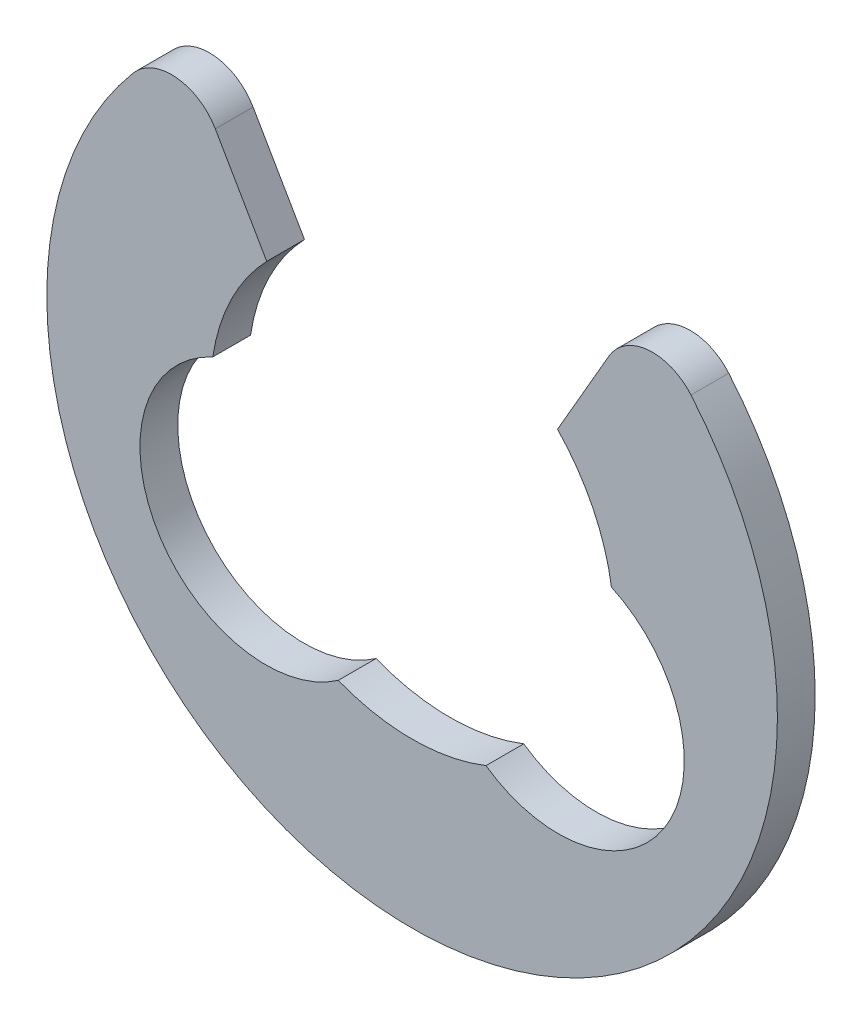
ISO-10303-21;
HEADER;
FILE_DESCRIPTION(('STEP AP214'),'2;1');
FILE_NAME('part.step','',(''),(''),'','','');
FILE_SCHEMA(('AUTOMOTIVE_DESIGN { 1 0 10303 214 1 1 1 1 }'));
ENDSEC;
DATA;
#1=APPLICATION_CONTEXT('core data for automotive mechanical design processes');
#2=APPLICATION_PROTOCOL_DEFINITION('international standard','automotive_design',2000,#1);
#3=PRODUCT_CONTEXT('',#1,'mechanical');
#4=PRODUCT('Part','Part','',(#3));
#5=PRODUCT_RELATED_PRODUCT_CATEGORY('part','',(#4));
#6=PRODUCT_DEFINITION_FORMATION('','',#4);
#7=PRODUCT_DEFINITION_CONTEXT('part definition',#1,'design');
#8=PRODUCT_DEFINITION('design','',#6,#7);
#9=PRODUCT_DEFINITION_SHAPE('','',#8);
#10=(LENGTH_UNIT() NAMED_UNIT(*) SI_UNIT(.MILLI.,.METRE.));
#11=(NAMED_UNIT(*) PLANE_ANGLE_UNIT() SI_UNIT($,.RADIAN.));
#12=(NAMED_UNIT(*) SI_UNIT($,.STERADIAN.) SOLID_ANGLE_UNIT());
#13=UNCERTAINTY_MEASURE_WITH_UNIT(LENGTH_MEASURE(1.E-05),#10,'distance_accuracy_value','');
#14=(GEOMETRIC_REPRESENTATION_CONTEXT(3) GLOBAL_UNCERTAINTY_ASSIGNED_CONTEXT((#13)) GLOBAL_UNIT_ASSIGNED_CONTEXT((#10,
#11,#12)) REPRESENTATION_CONTEXT('',''));
#15=CARTESIAN_POINT('',(0.,0.,0.));
#16=DIRECTION('',(0.,0.,1.));
#17=DIRECTION('',(1.,0.,0.));
#18=AXIS2_PLACEMENT_3D('',#15,#16,#17);
#19=CARTESIAN_POINT('',(0.,0.,1.5));
#20=DIRECTION('',(0.,0.,-1.));
#21=DIRECTION('',(-1.,0.,0.));
#22=AXIS2_PLACEMENT_3D('',#19,#20,#21);
#23=CYLINDRICAL_SURFACE('',#22,8.);
#24=CARTESIAN_POINT('',(0.,0.,0.));
#25=DIRECTION('',(0.,0.,-1.));
#26=DIRECTION('',(1.,0.,0.));
#27=AXIS2_PLACEMENT_3D('',#24,#25,#26);
#28=CIRCLE('',#27,8.);
#29=CARTESIAN_POINT('',(-7.91202775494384,1.18313854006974,0.));
#30=VERTEX_POINT('',#29);
#31=CARTESIAN_POINT('',(-5.77134299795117,5.54,0.));
#32=VERTEX_POINT('',#31);
#33=EDGE_CURVE('E127',#30,#32,#28,.T.);
#34=ORIENTED_EDGE('',*,*,#33,.T.);
#35=DIRECTION('',(0.,0.,-1.));
#36=VECTOR('',#35,1.);
#37=CARTESIAN_POINT('',(-5.77134299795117,5.54,1.5));
#38=LINE('',#37,#36);
#39=CARTESIAN_POINT('',(-5.77134299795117,5.54,1.5));
#40=VERTEX_POINT('',#39);
#41=EDGE_CURVE('E110',#40,#32,#38,.T.);
#42=ORIENTED_EDGE('',*,*,#41,.F.);
#43=CARTESIAN_POINT('',(0.,0.,1.5));
#44=DIRECTION('',(0.,0.,-1.));
#45=DIRECTION('',(1.,0.,0.));
#46=AXIS2_PLACEMENT_3D('',#43,#44,#45);
#47=CIRCLE('',#46,8.);
#48=CARTESIAN_POINT('',(-7.91202775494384,1.18313854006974,1.5));
#49=VERTEX_POINT('',#48);
#50=EDGE_CURVE('E115',#49,#40,#47,.T.);
#51=ORIENTED_EDGE('',*,*,#50,.F.);
#52=DIRECTION('',(0.,0.,-1.));
#53=VECTOR('',#52,1.);
#54=CARTESIAN_POINT('',(-7.91202775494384,1.18313854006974,1.5));
#55=LINE('',#54,#53);
#56=EDGE_CURVE('E181',#49,#30,#55,.T.);
#57=ORIENTED_EDGE('',*,*,#56,.T.);
#58=EDGE_LOOP('',(#34,#42,#51,#57));
#59=FACE_BOUND('',#58,.T.);
#60=ADVANCED_FACE('F30',(#59),#23,.F.);
#61=CARTESIAN_POINT('',(-5.77134299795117,5.54,1.5));
#62=DIRECTION('',(-0.866025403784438,-0.500000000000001,0.));
#63=DIRECTION('',(0.500000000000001,-0.866025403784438,0.));
#64=AXIS2_PLACEMENT_3D('',#61,#62,#63);
#65=PLANE('',#64);
#66=DIRECTION('',(-0.500000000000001,0.866025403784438,0.));
#67=VECTOR('',#66,1.);
#68=CARTESIAN_POINT('',(-5.77134299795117,5.54,0.));
#69=LINE('',#68,#67);
#70=CARTESIAN_POINT('',(-7.81121784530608,9.0731668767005,0.));
#71=VERTEX_POINT('',#70);
#72=EDGE_CURVE('E168',#32,#71,#69,.T.);
#73=ORIENTED_EDGE('',*,*,#72,.T.);
#74=DIRECTION('',(0.,0.,-1.));
#75=VECTOR('',#74,1.);
#76=CARTESIAN_POINT('',(-7.81121784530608,9.07316687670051,1.5));
#77=LINE('',#76,#75);
#78=CARTESIAN_POINT('',(-7.81121784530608,9.0731668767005,1.5));
#79=VERTEX_POINT('',#78);
#80=EDGE_CURVE('E11',#71,#79,#77,.F.);
#81=ORIENTED_EDGE('',*,*,#80,.T.);
#82=DIRECTION('',(-0.500000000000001,0.866025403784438,0.));
#83=VECTOR('',#82,1.);
#84=CARTESIAN_POINT('',(-5.77134299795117,5.54,1.5));
#85=LINE('',#84,#83);
#86=EDGE_CURVE('E106',#40,#79,#85,.T.);
#87=ORIENTED_EDGE('',*,*,#86,.F.);
#88=ORIENTED_EDGE('',*,*,#41,.T.);
#89=EDGE_LOOP('',(#73,#81,#87,#88));
#90=FACE_BOUND('',#89,.T.);
#91=ADVANCED_FACE('F108',(#90),#65,.F.);
#92=CARTESIAN_POINT('',(0.,0.,1.5));
#93=DIRECTION('',(0.,0.,-1.));
#94=DIRECTION('',(-1.,0.,0.));
#95=AXIS2_PLACEMENT_3D('',#92,#93,#94);
#96=CYLINDRICAL_SURFACE('',#95,14.5);
#97=CARTESIAN_POINT('',(0.,0.,0.));
#98=DIRECTION('',(0.,0.,1.));
#99=DIRECTION('',(1.,0.,0.));
#100=AXIS2_PLACEMENT_3D('',#97,#98,#99);
#101=CIRCLE('',#100,14.5);
#102=CARTESIAN_POINT('',(-11.070191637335,9.36487357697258,0.));
#103=VERTEX_POINT('',#102);
#104=CARTESIAN_POINT('',(11.070191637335,9.36487357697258,0.));
#105=VERTEX_POINT('',#104);
#106=EDGE_CURVE('E163',#103,#105,#101,.T.);
#107=ORIENTED_EDGE('',*,*,#106,.T.);
#108=DIRECTION('',(0.,0.,-1.));
#109=VECTOR('',#108,1.);
#110=CARTESIAN_POINT('',(11.070191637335,9.36487357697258,1.5));
#111=LINE('',#110,#109);
#112=CARTESIAN_POINT('',(11.070191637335,9.36487357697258,1.5));
#113=VERTEX_POINT('',#112);
#114=EDGE_CURVE('E51',#105,#113,#111,.F.);
#115=ORIENTED_EDGE('',*,*,#114,.T.);
#116=CARTESIAN_POINT('',(0.,0.,1.5));
#117=DIRECTION('',(0.,0.,1.));
#118=DIRECTION('',(1.,0.,0.));
#119=AXIS2_PLACEMENT_3D('',#116,#117,#118);
#120=CIRCLE('',#119,14.5);
#121=CARTESIAN_POINT('',(-11.070191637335,9.36487357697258,1.5));
#122=VERTEX_POINT('',#121);
#123=EDGE_CURVE('E114',#122,#113,#120,.T.);
#124=ORIENTED_EDGE('',*,*,#123,.F.);
#125=DIRECTION('',(0.,0.,-1.));
#126=VECTOR('',#125,1.);
#127=CARTESIAN_POINT('',(-11.070191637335,9.36487357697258,1.5));
#128=LINE('',#127,#126);
#129=EDGE_CURVE('E142',#122,#103,#128,.T.);
#130=ORIENTED_EDGE('',*,*,#129,.T.);
#131=EDGE_LOOP('',(#107,#115,#124,#130));
#132=FACE_BOUND('',#131,.T.);
#133=ADVANCED_FACE('F166',(#132),#96,.T.);
#134=CARTESIAN_POINT('',(5.77134299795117,5.54,1.5));
#135=DIRECTION('',(0.866025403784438,-0.500000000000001,0.));
#136=DIRECTION('',(0.500000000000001,0.866025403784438,0.));
#137=AXIS2_PLACEMENT_3D('',#134,#135,#136);
#138=PLANE('',#137);
#139=DIRECTION('',(-0.500000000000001,-0.866025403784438,0.));
#140=VECTOR('',#139,1.);
#141=CARTESIAN_POINT('',(5.77134299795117,5.54,1.5));
#142=LINE('',#141,#140);
#143=CARTESIAN_POINT('',(7.81121784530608,9.0731668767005,1.5));
#144=VERTEX_POINT('',#143);
#145=CARTESIAN_POINT('',(5.77134299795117,5.54,1.5));
#146=VERTEX_POINT('',#145);
#147=EDGE_CURVE('E149',#144,#146,#142,.T.);
#148=ORIENTED_EDGE('',*,*,#147,.F.);
#149=DIRECTION('',(0.,0.,-1.));
#150=VECTOR('',#149,1.);
#151=CARTESIAN_POINT('',(7.81121784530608,9.07316687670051,1.5));
#152=LINE('',#151,#150);
#153=CARTESIAN_POINT('',(7.81121784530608,9.0731668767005,0.));
#154=VERTEX_POINT('',#153);
#155=EDGE_CURVE('E128',#144,#154,#152,.T.);
#156=ORIENTED_EDGE('',*,*,#155,.T.);
#157=DIRECTION('',(-0.500000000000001,-0.866025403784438,0.));
#158=VECTOR('',#157,1.);
#159=CARTESIAN_POINT('',(5.77134299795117,5.54,0.));
#160=LINE('',#159,#158);
#161=CARTESIAN_POINT('',(5.77134299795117,5.54,0.));
#162=VERTEX_POINT('',#161);
#163=EDGE_CURVE('E165',#154,#162,#160,.T.);
#164=ORIENTED_EDGE('',*,*,#163,.T.);
#165=DIRECTION('',(0.,0.,-1.));
#166=VECTOR('',#165,1.);
#167=CARTESIAN_POINT('',(5.77134299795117,5.54,1.5));
#168=LINE('',#167,#166);
#169=EDGE_CURVE('E129',#146,#162,#168,.T.);
#170=ORIENTED_EDGE('',*,*,#169,.F.);
#171=EDGE_LOOP('',(#148,#156,#164,#170));
#172=FACE_BOUND('',#171,.T.);
#173=ADVANCED_FACE('F154',(#172),#138,.F.);
#174=CARTESIAN_POINT('',(0.,0.,1.5));
#175=DIRECTION('',(0.,0.,-1.));
#176=DIRECTION('',(-1.,0.,0.));
#177=AXIS2_PLACEMENT_3D('',#174,#175,#176);
#178=CYLINDRICAL_SURFACE('',#177,8.);
#179=CARTESIAN_POINT('',(0.,0.,0.));
#180=DIRECTION('',(0.,0.,-1.));
#181=DIRECTION('',(1.,0.,0.));
#182=AXIS2_PLACEMENT_3D('',#179,#180,#181);
#183=CIRCLE('',#182,8.);
#184=CARTESIAN_POINT('',(7.91202775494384,1.18313854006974,0.));
#185=VERTEX_POINT('',#184);
#186=EDGE_CURVE('E170',#162,#185,#183,.T.);
#187=ORIENTED_EDGE('',*,*,#186,.T.);
#188=DIRECTION('',(0.,0.,-1.));
#189=VECTOR('',#188,1.);
#190=CARTESIAN_POINT('',(7.91202775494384,1.18313854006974,1.5));
#191=LINE('',#190,#189);
#192=CARTESIAN_POINT('',(7.91202775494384,1.18313854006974,1.5));
#193=VERTEX_POINT('',#192);
#194=EDGE_CURVE('E135',#193,#185,#191,.T.);
#195=ORIENTED_EDGE('',*,*,#194,.F.);
#196=CARTESIAN_POINT('',(0.,0.,1.5));
#197=DIRECTION('',(0.,0.,-1.));
#198=DIRECTION('',(1.,0.,0.));
#199=AXIS2_PLACEMENT_3D('',#196,#197,#198);
#200=CIRCLE('',#199,8.);
#201=EDGE_CURVE('E157',#146,#193,#200,.T.);
#202=ORIENTED_EDGE('',*,*,#201,.F.);
#203=ORIENTED_EDGE('',*,*,#169,.T.);
#204=EDGE_LOOP('',(#187,#195,#202,#203));
#205=FACE_BOUND('',#204,.T.);
#206=ADVANCED_FACE('F211',(#205),#178,.F.);
#207=CARTESIAN_POINT('',(5.80237020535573,-3.35000000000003,1.5));
#208=DIRECTION('',(0.,0.,-1.));
#209=DIRECTION('',(-1.,0.,0.));
#210=AXIS2_PLACEMENT_3D('',#207,#208,#209);
#211=CYLINDRICAL_SURFACE('',#210,5.);
#212=CARTESIAN_POINT('',(5.80237020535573,-3.35000000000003,0.));
#213=DIRECTION('',(0.,0.,-1.));
#214=DIRECTION('',(1.,0.,0.));
#215=AXIS2_PLACEMENT_3D('',#212,#213,#214);
#216=CIRCLE('',#215,5.);
#217=CARTESIAN_POINT('',(2.93138584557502,-7.44358630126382,0.));
#218=VERTEX_POINT('',#217);
#219=EDGE_CURVE('E176',#185,#218,#216,.T.);
#220=ORIENTED_EDGE('',*,*,#219,.T.);
#221=DIRECTION('',(0.,0.,-1.));
#222=VECTOR('',#221,1.);
#223=CARTESIAN_POINT('',(2.93138584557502,-7.44358630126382,1.5));
#224=LINE('',#223,#222);
#225=CARTESIAN_POINT('',(2.93138584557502,-7.44358630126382,1.5));
#226=VERTEX_POINT('',#225);
#227=EDGE_CURVE('E186',#226,#218,#224,.T.);
#228=ORIENTED_EDGE('',*,*,#227,.F.);
#229=CARTESIAN_POINT('',(5.80237020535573,-3.35000000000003,1.5));
#230=DIRECTION('',(0.,0.,-1.));
#231=DIRECTION('',(1.,0.,0.));
#232=AXIS2_PLACEMENT_3D('',#229,#230,#231);
#233=CIRCLE('',#232,5.);
#234=EDGE_CURVE('E195',#193,#226,#233,.T.);
#235=ORIENTED_EDGE('',*,*,#234,.F.);
#236=ORIENTED_EDGE('',*,*,#194,.T.);
#237=EDGE_LOOP('',(#220,#228,#235,#236));
#238=FACE_BOUND('',#237,.T.);
#239=ADVANCED_FACE('F193',(#238),#211,.F.);
#240=CARTESIAN_POINT('',(0.,0.,1.5));
#241=DIRECTION('',(0.,0.,-1.));
#242=DIRECTION('',(-1.,0.,0.));
#243=AXIS2_PLACEMENT_3D('',#240,#241,#242);
#244=CYLINDRICAL_SURFACE('',#243,8.);
#245=CARTESIAN_POINT('',(0.,0.,0.));
#246=DIRECTION('',(0.,0.,-1.));
#247=DIRECTION('',(1.,0.,0.));
#248=AXIS2_PLACEMENT_3D('',#245,#246,#247);
#249=CIRCLE('',#248,8.);
#250=CARTESIAN_POINT('',(-2.93138584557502,-7.44358630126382,0.));
#251=VERTEX_POINT('',#250);
#252=EDGE_CURVE('E178',#218,#251,#249,.T.);
#253=ORIENTED_EDGE('',*,*,#252,.T.);
#254=DIRECTION('',(0.,0.,-1.));
#255=VECTOR('',#254,1.);
#256=CARTESIAN_POINT('',(-2.93138584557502,-7.44358630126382,1.5));
#257=LINE('',#256,#255);
#258=CARTESIAN_POINT('',(-2.93138584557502,-7.44358630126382,1.5));
#259=VERTEX_POINT('',#258);
#260=EDGE_CURVE('E183',#259,#251,#257,.T.);
#261=ORIENTED_EDGE('',*,*,#260,.F.);
#262=CARTESIAN_POINT('',(0.,0.,1.5));
#263=DIRECTION('',(0.,0.,-1.));
#264=DIRECTION('',(1.,0.,0.));
#265=AXIS2_PLACEMENT_3D('',#262,#263,#264);
#266=CIRCLE('',#265,8.);
#267=EDGE_CURVE('E205',#226,#259,#266,.T.);
#268=ORIENTED_EDGE('',*,*,#267,.F.);
#269=ORIENTED_EDGE('',*,*,#227,.T.);
#270=EDGE_LOOP('',(#253,#261,#268,#269));
#271=FACE_BOUND('',#270,.T.);
#272=ADVANCED_FACE('F201',(#271),#244,.F.);
#273=CARTESIAN_POINT('',(-5.80237020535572,-3.35000000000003,1.5));
#274=DIRECTION('',(0.,0.,-1.));
#275=DIRECTION('',(-1.,0.,0.));
#276=AXIS2_PLACEMENT_3D('',#273,#274,#275);
#277=CYLINDRICAL_SURFACE('',#276,5.);
#278=CARTESIAN_POINT('',(-5.80237020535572,-3.35000000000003,0.));
#279=DIRECTION('',(0.,0.,-1.));
#280=DIRECTION('',(1.,0.,0.));
#281=AXIS2_PLACEMENT_3D('',#278,#279,#280);
#282=CIRCLE('',#281,5.);
#283=EDGE_CURVE('E124',#251,#30,#282,.T.);
#284=ORIENTED_EDGE('',*,*,#283,.T.);
#285=ORIENTED_EDGE('',*,*,#56,.F.);
#286=CARTESIAN_POINT('',(-5.80237020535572,-3.35000000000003,1.5));
#287=DIRECTION('',(0.,0.,-1.));
#288=DIRECTION('',(1.,0.,0.));
#289=AXIS2_PLACEMENT_3D('',#286,#287,#288);
#290=CIRCLE('',#289,5.);
#291=EDGE_CURVE('E120',#259,#49,#290,.T.);
#292=ORIENTED_EDGE('',*,*,#291,.F.);
#293=ORIENTED_EDGE('',*,*,#260,.T.);
#294=EDGE_LOOP('',(#284,#285,#292,#293));
#295=FACE_BOUND('',#294,.T.);
#296=ADVANCED_FACE('F204',(#295),#277,.F.);
#297=CARTESIAN_POINT('',(0.,0.,1.5));
#298=DIRECTION('',(0.,0.,1.));
#299=DIRECTION('',(1.,0.,0.));
#300=AXIS2_PLACEMENT_3D('',#297,#298,#299);
#301=PLANE('',#300);
#302=ORIENTED_EDGE('',*,*,#123,.T.);
#303=CARTESIAN_POINT('',(9.54326865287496,8.0731668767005,1.5));
#304=DIRECTION('',(0.,0.,1.));
#305=DIRECTION('',(1.,0.,0.));
#306=AXIS2_PLACEMENT_3D('',#303,#304,#305);
#307=CIRCLE('',#306,2.);
#308=EDGE_CURVE('E38',#113,#144,#307,.T.);
#309=ORIENTED_EDGE('',*,*,#308,.T.);
#310=ORIENTED_EDGE('',*,*,#147,.T.);
#311=ORIENTED_EDGE('',*,*,#201,.T.);
#312=ORIENTED_EDGE('',*,*,#234,.T.);
#313=ORIENTED_EDGE('',*,*,#267,.T.);
#314=ORIENTED_EDGE('',*,*,#291,.T.);
#315=ORIENTED_EDGE('',*,*,#50,.T.);
#316=ORIENTED_EDGE('',*,*,#86,.T.);
#317=CARTESIAN_POINT('',(-9.54326865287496,8.0731668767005,1.5));
#318=DIRECTION('',(0.,0.,1.));
#319=DIRECTION('',(1.,0.,0.));
#320=AXIS2_PLACEMENT_3D('',#317,#318,#319);
#321=CIRCLE('',#320,2.);
#322=EDGE_CURVE('E146',#79,#122,#321,.T.);
#323=ORIENTED_EDGE('',*,*,#322,.T.);
#324=EDGE_LOOP('',(#302,#309,#310,#311,#312,#313,#314,#315,#316,#323));
#325=FACE_BOUND('',#324,.T.);
#326=ADVANCED_FACE('F118',(#325),#301,.T.);
#327=CARTESIAN_POINT('',(0.,0.,0.));
#328=DIRECTION('',(0.,0.,1.));
#329=DIRECTION('',(1.,0.,0.));
#330=AXIS2_PLACEMENT_3D('',#327,#328,#329);
#331=PLANE('',#330);
#332=ORIENTED_EDGE('',*,*,#163,.F.);
#333=CARTESIAN_POINT('',(9.54326865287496,8.0731668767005,0.));
#334=DIRECTION('',(0.,0.,1.));
#335=DIRECTION('',(1.,0.,0.));
#336=AXIS2_PLACEMENT_3D('',#333,#334,#335);
#337=CIRCLE('',#336,2.);
#338=EDGE_CURVE('E140',#154,#105,#337,.F.);
#339=ORIENTED_EDGE('',*,*,#338,.T.);
#340=ORIENTED_EDGE('',*,*,#106,.F.);
#341=CARTESIAN_POINT('',(-9.54326865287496,8.0731668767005,0.));
#342=DIRECTION('',(0.,0.,1.));
#343=DIRECTION('',(1.,0.,0.));
#344=AXIS2_PLACEMENT_3D('',#341,#342,#343);
#345=CIRCLE('',#344,2.);
#346=EDGE_CURVE('E132',#103,#71,#345,.F.);
#347=ORIENTED_EDGE('',*,*,#346,.T.);
#348=ORIENTED_EDGE('',*,*,#72,.F.);
#349=ORIENTED_EDGE('',*,*,#33,.F.);
#350=ORIENTED_EDGE('',*,*,#283,.F.);
#351=ORIENTED_EDGE('',*,*,#252,.F.);
#352=ORIENTED_EDGE('',*,*,#219,.F.);
#353=ORIENTED_EDGE('',*,*,#186,.F.);
#354=EDGE_LOOP('',(#332,#339,#340,#347,#348,#349,#350,#351,#352,#353));
#355=FACE_BOUND('',#354,.T.);
#356=ADVANCED_FACE('F162',(#355),#331,.F.);
#357=CARTESIAN_POINT('',(9.54326865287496,8.0731668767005,1.5));
#358=DIRECTION('',(0.,0.,-1.));
#359=DIRECTION('',(-1.,0.,0.));
#360=AXIS2_PLACEMENT_3D('',#357,#358,#359);
#361=CYLINDRICAL_SURFACE('',#360,2.);
#362=ORIENTED_EDGE('',*,*,#308,.F.);
#363=ORIENTED_EDGE('',*,*,#114,.F.);
#364=ORIENTED_EDGE('',*,*,#338,.F.);
#365=ORIENTED_EDGE('',*,*,#155,.F.);
#366=EDGE_LOOP('',(#362,#363,#364,#365));
#367=FACE_BOUND('',#366,.T.);
#368=ADVANCED_FACE('F159',(#367),#361,.T.);
#369=CARTESIAN_POINT('',(-9.54326865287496,8.0731668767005,1.5));
#370=DIRECTION('',(0.,0.,-1.));
#371=DIRECTION('',(-1.,0.,0.));
#372=AXIS2_PLACEMENT_3D('',#369,#370,#371);
#373=CYLINDRICAL_SURFACE('',#372,2.);
#374=ORIENTED_EDGE('',*,*,#322,.F.);
#375=ORIENTED_EDGE('',*,*,#80,.F.);
#376=ORIENTED_EDGE('',*,*,#346,.F.);
#377=ORIENTED_EDGE('',*,*,#129,.F.);
#378=EDGE_LOOP('',(#374,#375,#376,#377));
#379=FACE_BOUND('',#378,.T.);
#380=ADVANCED_FACE('F32',(#379),#373,.T.);
#381=CLOSED_SHELL('',(#60,#91,#133,#173,#206,#239,#272,#296,#326,#356,#368,#380));
#382=MANIFOLD_SOLID_BREP('B2',#381);
#383=ADVANCED_BREP_SHAPE_REPRESENTATION('',(#18,#382),#14);
#384=SHAPE_DEFINITION_REPRESENTATION(#9,#383);
ENDSEC;
END-ISO-10303-21;
